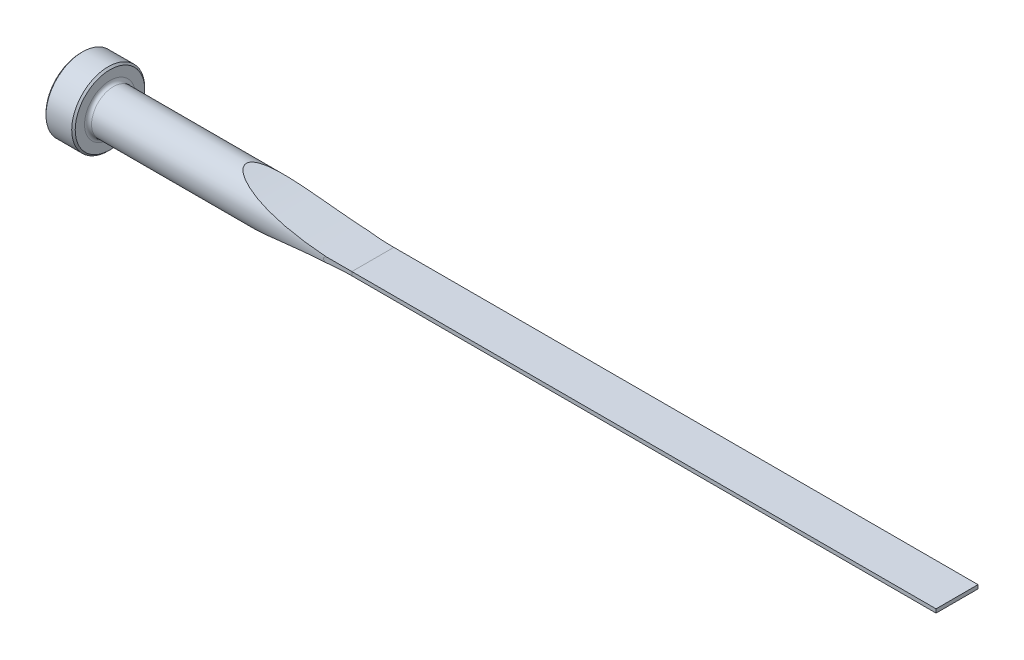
ISO-10303-21;
HEADER;
FILE_DESCRIPTION(('STEP AP214'),'2;1');
FILE_NAME('part.step','',(''),(''),'','','');
FILE_SCHEMA(('AUTOMOTIVE_DESIGN { 1 0 10303 214 1 1 1 1 }'));
ENDSEC;
DATA;
#1=APPLICATION_CONTEXT('core data for automotive mechanical design processes');
#2=APPLICATION_PROTOCOL_DEFINITION('international standard','automotive_design',2000,#1);
#3=PRODUCT_CONTEXT('',#1,'mechanical');
#4=PRODUCT('Part','Part','',(#3));
#5=PRODUCT_RELATED_PRODUCT_CATEGORY('part','',(#4));
#6=PRODUCT_DEFINITION_FORMATION('','',#4);
#7=PRODUCT_DEFINITION_CONTEXT('part definition',#1,'design');
#8=PRODUCT_DEFINITION('design','',#6,#7);
#9=PRODUCT_DEFINITION_SHAPE('','',#8);
#10=(LENGTH_UNIT() NAMED_UNIT(*) SI_UNIT(.MILLI.,.METRE.));
#11=(NAMED_UNIT(*) PLANE_ANGLE_UNIT() SI_UNIT($,.RADIAN.));
#12=(NAMED_UNIT(*) SI_UNIT($,.STERADIAN.) SOLID_ANGLE_UNIT());
#13=UNCERTAINTY_MEASURE_WITH_UNIT(LENGTH_MEASURE(1.E-05),#10,'distance_accuracy_value','');
#14=(GEOMETRIC_REPRESENTATION_CONTEXT(3) GLOBAL_UNCERTAINTY_ASSIGNED_CONTEXT((#13)) GLOBAL_UNIT_ASSIGNED_CONTEXT((#10,
#11,#12)) REPRESENTATION_CONTEXT('',''));
#15=CARTESIAN_POINT('',(0.,0.,0.));
#16=DIRECTION('',(0.,0.,1.));
#17=DIRECTION('',(1.,0.,0.));
#18=AXIS2_PLACEMENT_3D('',#15,#16,#17);
#19=CARTESIAN_POINT('',(0.,0.,0.));
#20=DIRECTION('',(-1.,0.,0.));
#21=DIRECTION('',(0.,0.,1.));
#22=AXIS2_PLACEMENT_3D('',#19,#20,#21);
#23=CYLINDRICAL_SURFACE('',#22,4.7625);
#24=CARTESIAN_POINT('',(7.112,0.,0.));
#25=DIRECTION('',(-1.,0.,0.));
#26=DIRECTION('',(0.,0.,1.));
#27=AXIS2_PLACEMENT_3D('',#24,#25,#26);
#28=CIRCLE('',#27,4.7625);
#29=CARTESIAN_POINT('',(7.112,0.,4.7625));
#30=VERTEX_POINT('',#29);
#31=EDGE_CURVE('E153',#30,#30,#28,.F.);
#32=ORIENTED_EDGE('',*,*,#31,.T.);
#33=EDGE_LOOP('',(#32));
#34=FACE_BOUND('',#33,.T.);
#35=CARTESIAN_POINT('',(63.5,1.37629566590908,4.55929999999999));
#36=CARTESIAN_POINT('',(63.300243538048,1.37627017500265,4.55929946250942));
#37=CARTESIAN_POINT('',(63.1004832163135,1.37406392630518,4.55997325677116));
#38=CARTESIAN_POINT('',(62.7010249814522,1.36511039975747,4.56266611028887));
#39=CARTESIAN_POINT('',(62.5013270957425,1.35836200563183,4.56468550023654));
#40=CARTESIAN_POINT('',(62.1003478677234,1.34006170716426,4.57009060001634));
#41=CARTESIAN_POINT('',(61.8990686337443,1.32846669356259,4.57348856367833));
#42=CARTESIAN_POINT('',(61.4969284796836,1.30007175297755,4.58164172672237));
#43=CARTESIAN_POINT('',(61.296067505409,1.28327254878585,4.58639673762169));
#44=CARTESIAN_POINT('',(60.8961767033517,1.2439534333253,4.59721659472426));
#45=CARTESIAN_POINT('',(60.6971431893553,1.22146913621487,4.6032732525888));
#46=CARTESIAN_POINT('',(60.2999040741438,1.16973426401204,4.61669265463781));
#47=CARTESIAN_POINT('',(60.1016988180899,1.14048110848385,4.62405589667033));
#48=CARTESIAN_POINT('',(59.7074850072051,1.07370926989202,4.64001372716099));
#49=CARTESIAN_POINT('',(59.5114710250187,1.03622172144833,4.64860363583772));
#50=CARTESIAN_POINT('',(59.1219644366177,0.950234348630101,4.66695416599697));
#51=CARTESIAN_POINT('',(58.9284697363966,0.901744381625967,4.67671373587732));
#52=CARTESIAN_POINT('',(58.689568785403,0.830609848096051,4.68952997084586));
#53=CARTESIAN_POINT('',(58.6417966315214,0.815810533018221,4.69213189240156));
#54=CARTESIAN_POINT('',(58.5466454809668,0.784967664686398,4.69739068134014));
#55=CARTESIAN_POINT('',(58.4992665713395,0.768923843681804,4.70004756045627));
#56=CARTESIAN_POINT('',(58.3571752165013,0.718404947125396,4.70812874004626));
#57=CARTESIAN_POINT('',(58.263234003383,0.681752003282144,4.71362458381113));
#58=CARTESIAN_POINT('',(58.0775344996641,0.599731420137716,4.72477713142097));
#59=CARTESIAN_POINT('',(57.9858203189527,0.554256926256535,4.73043499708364));
#60=CARTESIAN_POINT('',(57.8546141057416,0.476034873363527,4.73871868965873));
#61=CARTESIAN_POINT('',(57.8120990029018,0.448424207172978,4.7414354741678));
#62=CARTESIAN_POINT('',(57.7304247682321,0.388667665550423,4.74670987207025));
#63=CARTESIAN_POINT('',(57.6912549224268,0.356537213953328,4.74926798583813));
#64=CARTESIAN_POINT('',(57.6343845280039,0.30109449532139,4.75301502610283));
#65=CARTESIAN_POINT('',(57.6146643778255,0.279884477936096,4.75432176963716));
#66=CARTESIAN_POINT('',(57.578171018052,0.235020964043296,4.75675058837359));
#67=CARTESIAN_POINT('',(57.5613938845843,0.211370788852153,4.75787290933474));
#68=CARTESIAN_POINT('',(57.5361358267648,0.168085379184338,4.75956809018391));
#69=CARTESIAN_POINT('',(57.526635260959,0.149056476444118,4.76020769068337));
#70=CARTESIAN_POINT('',(57.51078402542,0.10971358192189,4.76127659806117));
#71=CARTESIAN_POINT('',(57.5044294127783,0.089401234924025,4.76170616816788));
#72=CARTESIAN_POINT('',(57.4955459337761,0.0476995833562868,4.76230708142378));
#73=CARTESIAN_POINT('',(57.4930580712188,0.0263011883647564,4.76247565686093));
#74=CARTESIAN_POINT('',(57.4924127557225,-0.0165581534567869,4.76251936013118));
#75=CARTESIAN_POINT('',(57.4942536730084,-0.0380190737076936,4.76239459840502));
#76=CARTESIAN_POINT('',(57.5014223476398,-0.0771509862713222,4.76190953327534));
#77=CARTESIAN_POINT('',(57.5062147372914,-0.0949256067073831,4.76158540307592));
#78=CARTESIAN_POINT('',(57.5183183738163,-0.129583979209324,4.76076832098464));
#79=CARTESIAN_POINT('',(57.5256312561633,-0.146467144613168,4.76027525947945));
#80=CARTESIAN_POINT('',(57.5478239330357,-0.190109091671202,4.75878258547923));
#81=CARTESIAN_POINT('',(57.564497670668,-0.215945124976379,4.75766444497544));
#82=CARTESIAN_POINT('',(57.6015159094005,-0.264813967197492,4.75519504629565));
#83=CARTESIAN_POINT('',(57.6218718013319,-0.28783769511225,4.75384306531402));
#84=CARTESIAN_POINT('',(57.6862463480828,-0.353109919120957,4.74959319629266));
#85=CARTESIAN_POINT('',(57.7337556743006,-0.391849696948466,4.74648889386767));
#86=CARTESIAN_POINT('',(57.8332528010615,-0.462955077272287,4.74007706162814));
#87=CARTESIAN_POINT('',(57.8852557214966,-0.495297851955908,4.73676885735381));
#88=CARTESIAN_POINT('',(58.0324605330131,-0.578484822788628,4.72754240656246));
#89=CARTESIAN_POINT('',(58.1303120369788,-0.624585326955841,4.72156110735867));
#90=CARTESIAN_POINT('',(58.3296567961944,-0.708279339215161,4.70972175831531));
#91=CARTESIAN_POINT('',(58.431158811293,-0.745850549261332,4.70386406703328));
#92=CARTESIAN_POINT('',(58.637175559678,-0.815246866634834,4.69233729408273));
#93=CARTESIAN_POINT('',(58.7417096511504,-0.84701459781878,4.68667050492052));
#94=CARTESIAN_POINT('',(58.9519315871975,-0.905852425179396,4.67565197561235));
#95=CARTESIAN_POINT('',(59.0576177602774,-0.932928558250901,4.67029983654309));
#96=CARTESIAN_POINT('',(59.3472077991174,-1.00180171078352,4.65615804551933));
#97=CARTESIAN_POINT('',(59.5319939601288,-1.03994988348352,4.64770520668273));
#98=CARTESIAN_POINT('',(59.9031150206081,-1.10820041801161,4.63190013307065));
#99=CARTESIAN_POINT('',(60.0894504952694,-1.13829964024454,4.62454832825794));
#100=CARTESIAN_POINT('',(60.4634968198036,-1.19209136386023,4.61097562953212));
#101=CARTESIAN_POINT('',(60.6512097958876,-1.21576959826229,4.60475726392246));
#102=CARTESIAN_POINT('',(61.0272867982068,-1.25764094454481,4.59349611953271));
#103=CARTESIAN_POINT('',(61.2156508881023,-1.2758335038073,4.58845345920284));
#104=CARTESIAN_POINT('',(61.7534776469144,-1.32086317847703,4.57577149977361));
#105=CARTESIAN_POINT('',(62.1034775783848,-1.34186157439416,4.56957976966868));
#106=CARTESIAN_POINT('',(62.628033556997,-1.36263417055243,4.56340533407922));
#107=CARTESIAN_POINT('',(62.8023917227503,-1.36777128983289,4.56186604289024));
#108=CARTESIAN_POINT('',(63.151163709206,-1.37459791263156,4.55981341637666));
#109=CARTESIAN_POINT('',(63.3255775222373,-1.37628777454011,4.55929997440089));
#110=CARTESIAN_POINT('',(63.4999999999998,-1.37629566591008,4.55929999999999));
#111=B_SPLINE_CURVE_WITH_KNOTS('',3,(#35,#36,#37,#38,#39,#40,#41,#42,#43,#44,#45,#46,#47,#48,
#49,#50,#51,#52,#53,#54,#55,#56,#57,#58,#59,#60,#61,#62,#63,#64,#65,#66,#67,#68,#69,#70,#71,#72,
#73,#74,#75,#76,#77,#78,#79,#80,#81,#82,#83,#84,#85,#86,#87,#88,#89,#90,#91,#92,#93,#94,#95,#96,
#97,#98,#99,#100,#101,#102,#103,#104,#105,#106,#107,#108,#109,#110),.UNSPECIFIED.,.F.,.F.,(4,2,
2,2,2,2,2,2,2,2,2,2,2,2,2,2,2,2,2,2,2,2,2,2,2,2,2,2,2,2,2,2,2,2,2,2,2,4),(0.,0.599262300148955,
1.19867192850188,1.80353056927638,2.40830524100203,3.00938132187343,3.6106869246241,
4.20975694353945,4.80829234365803,4.95851786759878,5.10877580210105,5.41155733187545,
5.71826557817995,5.87039269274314,6.0220127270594,6.10881533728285,6.19550132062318,
6.25911958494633,6.32265791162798,6.38686552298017,6.45104896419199,6.50606849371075,
6.56112379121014,6.65289509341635,6.74495530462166,6.92807013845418,7.11182707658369,
7.43597686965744,7.76096456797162,8.08900931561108,8.41662876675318,8.98296372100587,
9.54951926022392,10.1173235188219,10.6851849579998,11.7368092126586,12.2601040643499,
12.7833445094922),.UNSPECIFIED.);
#112=CARTESIAN_POINT('',(58.0309155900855,0.574787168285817,4.72768716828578));
#113=VERTEX_POINT('',#112);
#114=CARTESIAN_POINT('',(58.0309155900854,-0.574787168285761,4.72768716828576));
#115=VERTEX_POINT('',#114);
#116=EDGE_CURVE('E156',#113,#115,#111,.T.);
#117=ORIENTED_EDGE('',*,*,#116,.F.);
#118=CARTESIAN_POINT('',(63.5,0.406399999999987,4.74512858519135));
#119=CARTESIAN_POINT('',(63.1026745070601,0.406399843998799,4.7451190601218));
#120=CARTESIAN_POINT('',(62.7053493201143,0.409063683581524,4.74490020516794));
#121=CARTESIAN_POINT('',(61.910770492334,0.41971815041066,4.74397463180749));
#122=CARTESIAN_POINT('',(61.5135168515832,0.427708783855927,4.74326791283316));
#123=CARTESIAN_POINT('',(60.7191272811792,0.449016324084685,4.74129734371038));
#124=CARTESIAN_POINT('',(60.3219913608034,0.462333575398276,4.74003345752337));
#125=CARTESIAN_POINT('',(59.5279396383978,0.49429143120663,4.73680639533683));
#126=CARTESIAN_POINT('',(59.1310238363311,0.512932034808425,4.73484321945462));
#127=CARTESIAN_POINT('',(57.9394561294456,0.576901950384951,4.72763012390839));
#128=CARTESIAN_POINT('',(57.1452250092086,0.630246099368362,4.72105865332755));
#129=CARTESIAN_POINT('',(55.558589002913,0.758235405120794,4.70219684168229));
#130=CARTESIAN_POINT('',(54.76618404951,0.832879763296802,4.68990671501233));
#131=CARTESIAN_POINT('',(53.1835524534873,1.00343011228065,4.65640758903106));
#132=CARTESIAN_POINT('',(52.3933266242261,1.09934317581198,4.63519562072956));
#133=CARTESIAN_POINT('',(51.2104443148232,1.25905368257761,4.59338453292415));
#134=CARTESIAN_POINT('',(50.8165274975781,1.31493588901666,4.57778029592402));
#135=CARTESIAN_POINT('',(50.0296586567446,1.43195490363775,4.54253855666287));
#136=CARTESIAN_POINT('',(49.6367066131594,1.4930916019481,4.52290113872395));
#137=CARTESIAN_POINT('',(48.8518575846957,1.62059720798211,4.47879686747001));
#138=CARTESIAN_POINT('',(48.4599607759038,1.68696693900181,4.45432925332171));
#139=CARTESIAN_POINT('',(47.6774903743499,1.82488195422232,4.39962705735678));
#140=CARTESIAN_POINT('',(47.2869167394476,1.89642707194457,4.36939266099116));
#141=CARTESIAN_POINT('',(46.5074212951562,2.04461214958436,4.30204521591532));
#142=CARTESIAN_POINT('',(46.1184991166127,2.12125089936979,4.26493379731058));
#143=CARTESIAN_POINT('',(45.3425664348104,2.27953993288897,4.18247202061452));
#144=CARTESIAN_POINT('',(44.9555558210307,2.3611899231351,4.13712214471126));
#145=CARTESIAN_POINT('',(44.1831933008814,2.52951682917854,4.03640907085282));
#146=CARTESIAN_POINT('',(43.7978455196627,2.61620235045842,3.98102836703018));
#147=CARTESIAN_POINT('',(43.0301002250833,2.79427071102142,3.858130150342));
#148=CARTESIAN_POINT('',(42.6477031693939,2.88565426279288,3.79061079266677));
#149=CARTESIAN_POINT('',(41.8876227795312,3.07260204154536,3.64072869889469));
#150=CARTESIAN_POINT('',(41.5099315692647,3.16815757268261,3.55839581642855));
#151=CARTESIAN_POINT('',(40.9476753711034,3.31430622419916,3.42070481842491));
#152=CARTESIAN_POINT('',(40.7609951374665,3.36348479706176,3.37245005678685));
#153=CARTESIAN_POINT('',(40.3893485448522,3.46267714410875,3.27052654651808));
#154=CARTESIAN_POINT('',(40.2043820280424,3.51269084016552,3.21685830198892));
#155=CARTESIAN_POINT('',(39.8792293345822,3.60172890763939,3.1164639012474));
#156=CARTESIAN_POINT('',(39.7386096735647,3.64061088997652,3.0710157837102));
#157=CARTESIAN_POINT('',(39.4588579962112,3.71869891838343,2.97598216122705));
#158=CARTESIAN_POINT('',(39.3197259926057,3.75790496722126,2.92639662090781));
#159=CARTESIAN_POINT('',(39.0431177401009,3.83657136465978,2.82247755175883));
#160=CARTESIAN_POINT('',(38.9056435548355,3.87603195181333,2.76813868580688));
#161=CARTESIAN_POINT('',(38.6329587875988,3.95500631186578,2.65408085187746));
#162=CARTESIAN_POINT('',(38.4977480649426,3.99452008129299,2.59436221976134));
#163=CARTESIAN_POINT('',(38.2292960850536,4.07365258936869,2.46826704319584));
#164=CARTESIAN_POINT('',(38.0960740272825,4.11327026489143,2.40184867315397));
#165=CARTESIAN_POINT('',(37.8333710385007,4.19204775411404,2.26155326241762));
#166=CARTESIAN_POINT('',(37.7038915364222,4.2312073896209,2.1876734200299));
#167=CARTESIAN_POINT('',(37.4499378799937,4.30862416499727,2.03096404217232));
#168=CARTESIAN_POINT('',(37.3254689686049,4.34688034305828,1.94812545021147));
#169=CARTESIAN_POINT('',(37.0838358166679,4.42170051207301,1.77176900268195));
#170=CARTESIAN_POINT('',(36.9666646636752,4.45826609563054,1.67826149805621));
#171=CARTESIAN_POINT('',(36.7877199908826,4.51448373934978,1.5181774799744));
#172=CARTESIAN_POINT('',(36.7225277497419,4.5350529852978,1.45578096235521));
#173=CARTESIAN_POINT('',(36.5971449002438,4.57476044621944,1.3257517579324));
#174=CARTESIAN_POINT('',(36.5369568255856,4.59389793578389,1.25811645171));
#175=CARTESIAN_POINT('',(36.3668727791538,4.64816205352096,1.04732254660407));
#176=CARTESIAN_POINT('',(36.2661556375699,4.680550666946,0.895181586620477));
#177=CARTESIAN_POINT('',(36.1489814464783,4.71837774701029,0.651766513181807));
#178=CARTESIAN_POINT('',(36.1158107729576,4.72911592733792,0.569337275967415));
#179=CARTESIAN_POINT('',(36.0623594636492,4.74644103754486,0.399912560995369));
#180=CARTESIAN_POINT('',(36.0420697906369,4.75303087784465,0.312920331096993));
#181=CARTESIAN_POINT('',(36.0163479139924,4.76138789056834,0.135923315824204));
#182=CARTESIAN_POINT('',(36.0110091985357,4.76312471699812,0.0459031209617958));
#183=CARTESIAN_POINT('',(36.0160954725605,4.76147114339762,-0.133645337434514));
#184=CARTESIAN_POINT('',(36.0265224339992,4.75808010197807,-0.223173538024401));
#185=CARTESIAN_POINT('',(36.0607143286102,4.74697779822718,-0.392888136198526));
#186=CARTESIAN_POINT('',(36.0835203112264,4.73957720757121,-0.473295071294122));
#187=CARTESIAN_POINT('',(36.1398597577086,4.72133273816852,-0.62979513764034));
#188=CARTESIAN_POINT('',(36.1733984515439,4.71048718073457,-0.705886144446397));
#189=CARTESIAN_POINT('',(36.2738381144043,4.67809283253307,-0.901152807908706));
#190=CARTESIAN_POINT('',(36.3482314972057,4.65417680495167,-1.01606031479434));
#191=CARTESIAN_POINT('',(36.5128356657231,4.60155676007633,-1.23272194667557));
#192=CARTESIAN_POINT('',(36.6030978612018,4.57283719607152,-1.33443139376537));
#193=CARTESIAN_POINT('',(36.7883758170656,4.51425401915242,-1.52046591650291));
#194=CARTESIAN_POINT('',(36.8827773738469,4.48456363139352,-1.60546923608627));
#195=CARTESIAN_POINT('',(37.0782410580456,4.42347381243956,-1.76684360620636));
#196=CARTESIAN_POINT('',(37.1793094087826,4.39207278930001,-1.84320640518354));
#197=CARTESIAN_POINT('',(37.3864508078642,4.32814203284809,-1.98869631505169));
#198=CARTESIAN_POINT('',(37.4925332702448,4.29561020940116,-2.05780896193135));
#199=CARTESIAN_POINT('',(37.708284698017,4.22990413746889,-2.18968796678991));
#200=CARTESIAN_POINT('',(37.8179522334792,4.1967301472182,-2.25245681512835));
#201=CARTESIAN_POINT('',(38.1008694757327,4.11176216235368,-2.40544145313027));
#202=CARTESIAN_POINT('',(38.2760784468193,4.05971107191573,-2.49188484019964));
#203=CARTESIAN_POINT('',(38.6312638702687,3.95541706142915,-2.65431239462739));
#204=CARTESIAN_POINT('',(38.8112427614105,3.90317405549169,-2.73029108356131));
#205=CARTESIAN_POINT('',(39.1750027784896,3.79885427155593,-2.87367043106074));
#206=CARTESIAN_POINT('',(39.358790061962,3.74677795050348,-2.94105569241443));
#207=CARTESIAN_POINT('',(39.7290553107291,3.64316890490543,-3.06846263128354));
#208=CARTESIAN_POINT('',(39.915533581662,3.59163624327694,-3.12848346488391));
#209=CARTESIAN_POINT('',(40.2915924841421,3.48904737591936,-3.2425089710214));
#210=CARTESIAN_POINT('',(40.481184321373,3.43799514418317,-3.29648006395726));
#211=CARTESIAN_POINT('',(40.8620944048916,3.33678868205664,-3.39888617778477));
#212=CARTESIAN_POINT('',(41.0534127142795,3.2866344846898,-3.44732099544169));
#213=CARTESIAN_POINT('',(41.4372368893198,3.18739089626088,-3.53928192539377));
#214=CARTESIAN_POINT('',(41.6297410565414,3.13830030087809,-3.58281385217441));
#215=CARTESIAN_POINT('',(42.0159311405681,3.04120169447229,-3.66559149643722));
#216=CARTESIAN_POINT('',(42.2096170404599,2.99319366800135,-3.70483727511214));
#217=CARTESIAN_POINT('',(42.7916930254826,2.85100463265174,-3.81677454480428));
#218=CARTESIAN_POINT('',(43.1815995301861,2.75852978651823,-3.88378247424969));
#219=CARTESIAN_POINT('',(43.9644614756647,2.57846824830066,-4.00558232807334));
#220=CARTESIAN_POINT('',(44.3574174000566,2.49088235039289,-4.06037227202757));
#221=CARTESIAN_POINT('',(45.1458992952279,2.32077052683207,-4.15994533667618));
#222=CARTESIAN_POINT('',(45.5414265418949,2.2382473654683,-4.2047230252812));
#223=CARTESIAN_POINT('',(46.3343932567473,2.07844836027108,-4.28596381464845));
#224=CARTESIAN_POINT('',(46.7318327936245,2.00117270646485,-4.32242661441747));
#225=CARTESIAN_POINT('',(47.5292695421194,1.85177898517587,-4.38850836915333));
#226=CARTESIAN_POINT('',(47.9292706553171,1.77967421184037,-4.41811009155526));
#227=CARTESIAN_POINT('',(48.7306003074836,1.64089830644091,-4.47150793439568));
#228=CARTESIAN_POINT('',(49.1319288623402,1.57422723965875,-4.49530398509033));
#229=CARTESIAN_POINT('',(49.9355884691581,1.44638497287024,-4.53805236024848));
#230=CARTESIAN_POINT('',(50.3379191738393,1.38521208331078,-4.55700617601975));
#231=CARTESIAN_POINT('',(51.1435512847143,1.26837488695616,-4.59089528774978));
#232=CARTESIAN_POINT('',(51.5468527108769,1.21271069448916,-4.60583050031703));
#233=CARTESIAN_POINT('',(52.7573121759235,1.05411059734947,-4.64566605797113));
#234=CARTESIAN_POINT('',(53.5657329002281,0.959454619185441,-4.6656313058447));
#235=CARTESIAN_POINT('',(55.1850679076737,0.792364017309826,-4.69688739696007));
#236=CARTESIAN_POINT('',(55.9959823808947,0.719931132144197,-4.70817756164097));
#237=CARTESIAN_POINT('',(57.6185284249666,0.597441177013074,-4.72528178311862));
#238=CARTESIAN_POINT('',(58.4301578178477,0.547356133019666,-4.731102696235));
#239=CARTESIAN_POINT('',(60.0544469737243,0.469475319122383,-4.73946638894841));
#240=CARTESIAN_POINT('',(60.8671066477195,0.441677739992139,-4.74200943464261));
#241=CARTESIAN_POINT('',(61.9834159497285,0.418818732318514,-4.74405084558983));
#242=CARTESIAN_POINT('',(62.2868904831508,0.414159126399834,-4.7444585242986));
#243=CARTESIAN_POINT('',(62.8935754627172,0.407951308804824,-4.74499664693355));
#244=CARTESIAN_POINT('',(63.1967858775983,0.406400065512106,-4.7451273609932));
#245=CARTESIAN_POINT('',(63.4999999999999,0.406399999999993,-4.74512858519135));
#246=B_SPLINE_CURVE_WITH_KNOTS('',3,(#118,#119,#120,#121,#122,#123,#124,#125,#126,#127,#128,
#129,#130,#131,#132,#133,#134,#135,#136,#137,#138,#139,#140,#141,#142,#143,#144,#145,#146,#147,
#148,#149,#150,#151,#152,#153,#154,#155,#156,#157,#158,#159,#160,#161,#162,#163,#164,#165,#166,
#167,#168,#169,#170,#171,#172,#173,#174,#175,#176,#177,#178,#179,#180,#181,#182,#183,#184,#185,
#186,#187,#188,#189,#190,#191,#192,#193,#194,#195,#196,#197,#198,#199,#200,#201,#202,#203,#204,
#205,#206,#207,#208,#209,#210,#211,#212,#213,#214,#215,#216,#217,#218,#219,#220,#221,#222,#223,
#224,#225,#226,#227,#228,#229,#230,#231,#232,#233,#234,#235,#236,#237,#238,#239,#240,#241,#242,
#243,#244,#245),.UNSPECIFIED.,.F.,.F.,(4,2,2,2,2,2,2,2,2,2,2,2,2,2,2,2,2,2,2,2,2,2,2,2,2,2,2,2,
2,2,2,2,2,2,2,2,2,2,2,2,2,2,2,2,2,2,2,2,2,2,2,2,2,2,2,2,2,2,2,2,2,2,2,4),(0.,1.19196684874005,
2.38393508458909,3.57598043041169,4.76802557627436,7.15583924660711,9.54356340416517,
11.9320827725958,13.1265378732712,14.3209680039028,15.5155864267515,16.7101664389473,
17.9044636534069,19.0986909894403,20.2950229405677,21.4915368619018,22.6856659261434,
23.282568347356,23.8794152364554,24.3377948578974,24.7961783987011,25.2550833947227,
25.7139597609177,26.175902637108,26.6380196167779,27.1006082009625,27.562751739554,
27.8401229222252,28.117633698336,28.6674621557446,28.9350509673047,29.2024518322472,
29.4715210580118,29.7406239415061,29.991359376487,30.2422171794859,30.6566912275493,
31.0725336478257,31.4633177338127,31.8544719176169,32.2463921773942,32.6381579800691,
33.2442660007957,33.8506901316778,34.4581859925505,35.06575140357,35.6765376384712,
36.2873462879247,36.8974227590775,37.5074905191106,38.7260446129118,39.9447960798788,
41.1642071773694,42.3836624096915,43.606148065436,44.8286484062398,46.0507717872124,
47.2729205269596,49.7150672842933,52.15740504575,54.5966769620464,57.035750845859,
57.9462702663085,58.8559012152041),.UNSPECIFIED.);
#247=CARTESIAN_POINT('',(58.0309155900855,0.574787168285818,-4.72768716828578));
#248=VERTEX_POINT('',#247);
#249=EDGE_CURVE('E106',#113,#248,#246,.T.);
#250=ORIENTED_EDGE('',*,*,#249,.T.);
#251=CARTESIAN_POINT('',(63.5,1.37629566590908,-4.55929999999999));
#252=CARTESIAN_POINT('',(63.3002435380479,1.37627017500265,-4.55929946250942));
#253=CARTESIAN_POINT('',(63.1004832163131,1.37406392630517,-4.55997325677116));
#254=CARTESIAN_POINT('',(62.7010249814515,1.36511039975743,-4.56266611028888));
#255=CARTESIAN_POINT('',(62.5013270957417,1.35836200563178,-4.56468550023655));
#256=CARTESIAN_POINT('',(62.1003478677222,1.34006170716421,-4.57009060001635));
#257=CARTESIAN_POINT('',(61.899068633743,1.32846669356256,-4.57348856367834));
#258=CARTESIAN_POINT('',(61.496928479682,1.30007175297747,-4.58164172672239));
#259=CARTESIAN_POINT('',(61.2960675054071,1.28327254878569,-4.58639673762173));
#260=CARTESIAN_POINT('',(60.8961767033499,1.2439534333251,-4.59721659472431));
#261=CARTESIAN_POINT('',(60.6971431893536,1.22146913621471,-4.60327325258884));
#262=CARTESIAN_POINT('',(60.2999040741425,1.16973426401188,-4.61669265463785));
#263=CARTESIAN_POINT('',(60.1016988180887,1.14048110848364,-4.62405589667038));
#264=CARTESIAN_POINT('',(59.7074850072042,1.07370926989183,-4.64001372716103));
#265=CARTESIAN_POINT('',(59.5114710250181,1.03622172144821,-4.64860363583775));
#266=CARTESIAN_POINT('',(59.1219644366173,0.950234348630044,-4.66695416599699));
#267=CARTESIAN_POINT('',(58.9284697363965,0.901744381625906,-4.67671373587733));
#268=CARTESIAN_POINT('',(58.689568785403,0.830609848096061,-4.68952997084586));
#269=CARTESIAN_POINT('',(58.6417966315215,0.815810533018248,-4.69213189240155));
#270=CARTESIAN_POINT('',(58.546645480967,0.784967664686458,-4.69739068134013));
#271=CARTESIAN_POINT('',(58.4992665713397,0.76892384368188,-4.70004756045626));
#272=CARTESIAN_POINT('',(58.3571752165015,0.718404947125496,-4.70812874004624));
#273=CARTESIAN_POINT('',(58.2632340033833,0.681752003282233,-4.71362458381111));
#274=CARTESIAN_POINT('',(58.0775344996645,0.599731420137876,-4.72477713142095));
#275=CARTESIAN_POINT('',(57.9858203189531,0.554256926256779,-4.73043499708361));
#276=CARTESIAN_POINT('',(57.8546141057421,0.476034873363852,-4.7387186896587));
#277=CARTESIAN_POINT('',(57.8120990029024,0.448424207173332,-4.74143547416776));
#278=CARTESIAN_POINT('',(57.7304247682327,0.388667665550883,-4.74670987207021));
#279=CARTESIAN_POINT('',(57.6912549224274,0.356537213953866,-4.74926798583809));
#280=CARTESIAN_POINT('',(57.6343845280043,0.301094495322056,-4.75301502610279));
#281=CARTESIAN_POINT('',(57.6146643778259,0.279884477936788,-4.75432176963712));
#282=CARTESIAN_POINT('',(57.5781710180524,0.235020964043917,-4.75675058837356));
#283=CARTESIAN_POINT('',(57.5613938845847,0.211370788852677,-4.75787290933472));
#284=CARTESIAN_POINT('',(57.5361358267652,0.168085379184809,-4.7595680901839));
#285=CARTESIAN_POINT('',(57.5266352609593,0.149056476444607,-4.76020769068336));
#286=CARTESIAN_POINT('',(57.5107840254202,0.109713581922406,-4.76127659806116));
#287=CARTESIAN_POINT('',(57.5044294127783,0.0894012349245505,-4.76170616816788));
#288=CARTESIAN_POINT('',(57.495545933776,0.0476995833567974,-4.76230708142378));
#289=CARTESIAN_POINT('',(57.4930580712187,0.026301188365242,-4.76247565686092));
#290=CARTESIAN_POINT('',(57.4924127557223,-0.0165581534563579,-4.76251936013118));
#291=CARTESIAN_POINT('',(57.4942536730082,-0.0380190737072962,-4.76239459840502));
#292=CARTESIAN_POINT('',(57.5014223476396,-0.0771509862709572,-4.76190953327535));
#293=CARTESIAN_POINT('',(57.5062147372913,-0.0949256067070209,-4.76158540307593));
#294=CARTESIAN_POINT('',(57.5183183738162,-0.129583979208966,-4.76076832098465));
#295=CARTESIAN_POINT('',(57.5256312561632,-0.146467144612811,-4.76027525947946));
#296=CARTESIAN_POINT('',(57.5478239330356,-0.190109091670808,-4.75878258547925));
#297=CARTESIAN_POINT('',(57.5644976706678,-0.215945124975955,-4.75766444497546));
#298=CARTESIAN_POINT('',(57.6015159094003,-0.264813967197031,-4.75519504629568));
#299=CARTESIAN_POINT('',(57.6218718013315,-0.287837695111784,-4.75384306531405));
#300=CARTESIAN_POINT('',(57.6862463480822,-0.353109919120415,-4.7495931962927));
#301=CARTESIAN_POINT('',(57.7337556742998,-0.391849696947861,-4.74648889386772));
#302=CARTESIAN_POINT('',(57.8332528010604,-0.462955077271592,-4.7400770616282));
#303=CARTESIAN_POINT('',(57.8852557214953,-0.495297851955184,-4.73676885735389));
#304=CARTESIAN_POINT('',(58.0324605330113,-0.578484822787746,-4.72754240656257));
#305=CARTESIAN_POINT('',(58.1303120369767,-0.624585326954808,-4.72156110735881));
#306=CARTESIAN_POINT('',(58.3296567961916,-0.708279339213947,-4.70972175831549));
#307=CARTESIAN_POINT('',(58.4311588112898,-0.74585054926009,-4.70386406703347));
#308=CARTESIAN_POINT('',(58.6371755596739,-0.815246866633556,-4.69233729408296));
#309=CARTESIAN_POINT('',(58.741709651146,-0.847014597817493,-4.68667050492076));
#310=CARTESIAN_POINT('',(58.9519315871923,-0.905852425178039,-4.67565197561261));
#311=CARTESIAN_POINT('',(59.0576177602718,-0.932928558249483,-4.67029983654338));
#312=CARTESIAN_POINT('',(59.3472077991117,-1.00180171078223,-4.65615804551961));
#313=CARTESIAN_POINT('',(59.5319939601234,-1.03994988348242,-4.64770520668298));
#314=CARTESIAN_POINT('',(59.9031150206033,-1.10820041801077,-4.63190013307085));
#315=CARTESIAN_POINT('',(60.0894504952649,-1.13829964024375,-4.62454832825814));
#316=CARTESIAN_POINT('',(60.4634968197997,-1.19209136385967,-4.61097562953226));
#317=CARTESIAN_POINT('',(60.651209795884,-1.21576959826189,-4.60475726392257));
#318=CARTESIAN_POINT('',(61.0272867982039,-1.25764094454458,-4.59349611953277));
#319=CARTESIAN_POINT('',(61.2156508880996,-1.27583350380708,-4.5884534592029));
#320=CARTESIAN_POINT('',(61.7534776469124,-1.32086317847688,-4.57577149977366));
#321=CARTESIAN_POINT('',(62.1034775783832,-1.34186157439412,-4.56957976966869));
#322=CARTESIAN_POINT('',(62.6280335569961,-1.36263417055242,-4.56340533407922));
#323=CARTESIAN_POINT('',(62.8023917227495,-1.36777128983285,-4.56186604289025));
#324=CARTESIAN_POINT('',(63.1511637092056,-1.37459791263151,-4.55981341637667));
#325=CARTESIAN_POINT('',(63.3255775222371,-1.37628777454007,-4.5592999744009));
#326=CARTESIAN_POINT('',(63.4999999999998,-1.37629566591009,-4.55929999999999));
#327=B_SPLINE_CURVE_WITH_KNOTS('',3,(#251,#252,#253,#254,#255,#256,#257,#258,#259,#260,#261,
#262,#263,#264,#265,#266,#267,#268,#269,#270,#271,#272,#273,#274,#275,#276,#277,#278,#279,#280,
#281,#282,#283,#284,#285,#286,#287,#288,#289,#290,#291,#292,#293,#294,#295,#296,#297,#298,#299,
#300,#301,#302,#303,#304,#305,#306,#307,#308,#309,#310,#311,#312,#313,#314,#315,#316,#317,#318,
#319,#320,#321,#322,#323,#324,#325,#326),.UNSPECIFIED.,.F.,.F.,(4,2,2,2,2,2,2,2,2,2,2,2,2,2,2,2,
2,2,2,2,2,2,2,2,2,2,2,2,2,2,2,2,2,2,2,2,2,4),(0.,0.599262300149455,1.19867192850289,
1.80353056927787,2.40830524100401,3.00938132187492,3.61068692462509,4.20975694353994,
4.80829234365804,4.95851786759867,5.10877580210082,5.41155733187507,5.71826557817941,
5.87039269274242,6.02201272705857,6.10881533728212,6.19550132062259,6.25911958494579,
6.32265791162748,6.38686552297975,6.45104896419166,6.50606849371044,6.56112379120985,
6.65289509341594,6.7449553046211,6.92807013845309,7.11182707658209,7.43597686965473,
7.7609645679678,8.08900931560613,8.4166287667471,8.98296372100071,9.54951926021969,
10.1173235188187,10.6851849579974,11.7368092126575,12.2601040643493,12.7833445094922),.UNSPECIFIED.);
#328=CARTESIAN_POINT('',(58.0309155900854,-0.574787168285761,-4.72768716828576));
#329=VERTEX_POINT('',#328);
#330=EDGE_CURVE('E175',#248,#329,#327,.T.);
#331=ORIENTED_EDGE('',*,*,#330,.T.);
#332=CARTESIAN_POINT('',(63.5,-0.406399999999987,4.74512858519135));
#333=CARTESIAN_POINT('',(63.1026745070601,-0.406399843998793,4.7451190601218));
#334=CARTESIAN_POINT('',(62.7053493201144,-0.409063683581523,4.74490020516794));
#335=CARTESIAN_POINT('',(61.910770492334,-0.419718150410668,4.74397463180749));
#336=CARTESIAN_POINT('',(61.5135168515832,-0.42770878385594,4.74326791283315));
#337=CARTESIAN_POINT('',(60.7191272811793,-0.449016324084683,4.74129734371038));
#338=CARTESIAN_POINT('',(60.3219913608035,-0.462333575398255,4.74003345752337));
#339=CARTESIAN_POINT('',(59.5279396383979,-0.494291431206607,4.73680639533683));
#340=CARTESIAN_POINT('',(59.1310238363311,-0.51293203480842,4.73484321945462));
#341=CARTESIAN_POINT('',(57.9394561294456,-0.576901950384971,4.72763012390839));
#342=CARTESIAN_POINT('',(57.1452250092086,-0.630246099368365,4.72105865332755));
#343=CARTESIAN_POINT('',(55.5585890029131,-0.758235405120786,4.70219684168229));
#344=CARTESIAN_POINT('',(54.7661840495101,-0.8328797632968,4.68990671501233));
#345=CARTESIAN_POINT('',(53.1835524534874,-1.00343011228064,4.65640758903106));
#346=CARTESIAN_POINT('',(52.3933266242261,-1.09934317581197,4.63519562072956));
#347=CARTESIAN_POINT('',(51.2104443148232,-1.25905368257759,4.59338453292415));
#348=CARTESIAN_POINT('',(50.8165274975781,-1.31493588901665,4.57778029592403));
#349=CARTESIAN_POINT('',(50.0296586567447,-1.43195490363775,4.54253855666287));
#350=CARTESIAN_POINT('',(49.6367066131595,-1.4930916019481,4.52290113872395));
#351=CARTESIAN_POINT('',(48.8518575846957,-1.6205972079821,4.47879686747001));
#352=CARTESIAN_POINT('',(48.4599607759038,-1.6869669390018,4.45432925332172));
#353=CARTESIAN_POINT('',(47.67749037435,-1.82488195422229,4.39962705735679));
#354=CARTESIAN_POINT('',(47.2869167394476,-1.89642707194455,4.36939266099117));
#355=CARTESIAN_POINT('',(46.5074212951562,-2.04461214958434,4.30204521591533));
#356=CARTESIAN_POINT('',(46.1184991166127,-2.12125089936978,4.26493379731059));
#357=CARTESIAN_POINT('',(45.3425664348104,-2.27953993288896,4.18247202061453));
#358=CARTESIAN_POINT('',(44.9555558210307,-2.36118992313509,4.13712214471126));
#359=CARTESIAN_POINT('',(44.1831933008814,-2.52951682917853,4.03640907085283));
#360=CARTESIAN_POINT('',(43.7978455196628,-2.61620235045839,3.9810283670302));
#361=CARTESIAN_POINT('',(43.0301002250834,-2.7942707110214,3.85813015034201));
#362=CARTESIAN_POINT('',(42.647703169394,-2.88565426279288,3.79061079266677));
#363=CARTESIAN_POINT('',(41.8876227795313,-3.07260204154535,3.6407286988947));
#364=CARTESIAN_POINT('',(41.5099315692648,-3.16815757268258,3.55839581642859));
#365=CARTESIAN_POINT('',(40.9476753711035,-3.31430622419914,3.42070481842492));
#366=CARTESIAN_POINT('',(40.7609951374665,-3.36348479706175,3.37245005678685));
#367=CARTESIAN_POINT('',(40.3893485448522,-3.46267714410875,3.27052654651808));
#368=CARTESIAN_POINT('',(40.2043820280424,-3.5126908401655,3.21685830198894));
#369=CARTESIAN_POINT('',(39.8792293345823,-3.60172890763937,3.11646390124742));
#370=CARTESIAN_POINT('',(39.7386096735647,-3.64061088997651,3.07101578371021));
#371=CARTESIAN_POINT('',(39.4588579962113,-3.71869891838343,2.97598216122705));
#372=CARTESIAN_POINT('',(39.3197259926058,-3.75790496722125,2.92639662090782));
#373=CARTESIAN_POINT('',(39.043117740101,-3.83657136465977,2.82247755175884));
#374=CARTESIAN_POINT('',(38.9056435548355,-3.87603195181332,2.76813868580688));
#375=CARTESIAN_POINT('',(38.6329587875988,-3.95500631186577,2.65408085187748));
#376=CARTESIAN_POINT('',(38.4977480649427,-3.99452008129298,2.59436221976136));
#377=CARTESIAN_POINT('',(38.2292960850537,-4.07365258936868,2.46826704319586));
#378=CARTESIAN_POINT('',(38.0960740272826,-4.11327026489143,2.40184867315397));
#379=CARTESIAN_POINT('',(37.8333710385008,-4.19204775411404,2.26155326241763));
#380=CARTESIAN_POINT('',(37.7038915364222,-4.23120738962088,2.18767342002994));
#381=CARTESIAN_POINT('',(37.4499378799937,-4.30862416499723,2.03096404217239));
#382=CARTESIAN_POINT('',(37.3254689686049,-4.34688034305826,1.94812545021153));
#383=CARTESIAN_POINT('',(37.0838358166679,-4.42170051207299,1.77176900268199));
#384=CARTESIAN_POINT('',(36.9666646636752,-4.45826609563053,1.67826149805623));
#385=CARTESIAN_POINT('',(36.7877199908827,-4.51448373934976,1.51817747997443));
#386=CARTESIAN_POINT('',(36.7225277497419,-4.53505298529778,1.45578096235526));
#387=CARTESIAN_POINT('',(36.5971449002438,-4.57476044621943,1.32575175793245));
#388=CARTESIAN_POINT('',(36.5369568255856,-4.59389793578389,1.25811645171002));
#389=CARTESIAN_POINT('',(36.3668727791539,-4.64816205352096,1.04732254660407));
#390=CARTESIAN_POINT('',(36.2661556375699,-4.68055066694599,0.895181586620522));
#391=CARTESIAN_POINT('',(36.1489814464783,-4.71837774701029,0.651766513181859));
#392=CARTESIAN_POINT('',(36.1158107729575,-4.72911592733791,0.569337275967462));
#393=CARTESIAN_POINT('',(36.0623594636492,-4.74644103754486,0.399912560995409));
#394=CARTESIAN_POINT('',(36.0420697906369,-4.75303087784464,0.312920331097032));
#395=CARTESIAN_POINT('',(36.0163479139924,-4.76138789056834,0.135923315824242));
#396=CARTESIAN_POINT('',(36.0110091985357,-4.76312471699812,0.045903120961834));
#397=CARTESIAN_POINT('',(36.0160954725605,-4.76147114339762,-0.133645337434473));
#398=CARTESIAN_POINT('',(36.0265224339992,-4.75808010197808,-0.223173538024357));
#399=CARTESIAN_POINT('',(36.0607143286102,-4.74697779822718,-0.392888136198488));
#400=CARTESIAN_POINT('',(36.0835203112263,-4.73957720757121,-0.473295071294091));
#401=CARTESIAN_POINT('',(36.1398597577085,-4.72133273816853,-0.62979513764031));
#402=CARTESIAN_POINT('',(36.1733984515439,-4.71048718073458,-0.70588614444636));
#403=CARTESIAN_POINT('',(36.2738381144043,-4.67809283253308,-0.901152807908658));
#404=CARTESIAN_POINT('',(36.3482314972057,-4.65417680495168,-1.0160603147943));
#405=CARTESIAN_POINT('',(36.512835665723,-4.60155676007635,-1.23272194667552));
#406=CARTESIAN_POINT('',(36.6030978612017,-4.57283719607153,-1.33443139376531));
#407=CARTESIAN_POINT('',(36.7883758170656,-4.51425401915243,-1.52046591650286));
#408=CARTESIAN_POINT('',(36.8827773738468,-4.48456363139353,-1.60546923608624));
#409=CARTESIAN_POINT('',(37.0782410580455,-4.42347381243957,-1.76684360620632));
#410=CARTESIAN_POINT('',(37.1793094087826,-4.39207278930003,-1.84320640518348));
#411=CARTESIAN_POINT('',(37.3864508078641,-4.32814203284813,-1.98869631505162));
#412=CARTESIAN_POINT('',(37.4925332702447,-4.29561020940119,-2.05780896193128));
#413=CARTESIAN_POINT('',(37.7082846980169,-4.22990413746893,-2.18968796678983));
#414=CARTESIAN_POINT('',(37.8179522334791,-4.19673014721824,-2.25245681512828));
#415=CARTESIAN_POINT('',(38.1008694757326,-4.11176216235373,-2.40544145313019));
#416=CARTESIAN_POINT('',(38.2760784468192,-4.05971107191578,-2.49188484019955));
#417=CARTESIAN_POINT('',(38.6312638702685,-3.95541706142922,-2.6543123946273));
#418=CARTESIAN_POINT('',(38.8112427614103,-3.90317405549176,-2.73029108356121));
#419=CARTESIAN_POINT('',(39.1750027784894,-3.79885427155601,-2.87367043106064));
#420=CARTESIAN_POINT('',(39.3587900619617,-3.74677795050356,-2.94105569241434));
#421=CARTESIAN_POINT('',(39.7290553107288,-3.64316890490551,-3.06846263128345));
#422=CARTESIAN_POINT('',(39.9155335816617,-3.59163624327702,-3.12848346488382));
#423=CARTESIAN_POINT('',(40.2915924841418,-3.48904737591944,-3.24250897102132));
#424=CARTESIAN_POINT('',(40.4811843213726,-3.43799514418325,-3.29648006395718));
#425=CARTESIAN_POINT('',(40.8620944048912,-3.33678868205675,-3.39888617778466));
#426=CARTESIAN_POINT('',(41.0534127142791,-3.28663448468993,-3.44732099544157));
#427=CARTESIAN_POINT('',(41.4372368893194,-3.18739089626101,-3.53928192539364));
#428=CARTESIAN_POINT('',(41.629741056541,-3.1383003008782,-3.58281385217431));
#429=CARTESIAN_POINT('',(42.0159311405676,-3.04120169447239,-3.66559149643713));
#430=CARTESIAN_POINT('',(42.2096170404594,-2.99319366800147,-3.70483727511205));
#431=CARTESIAN_POINT('',(42.7916930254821,-2.85100463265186,-3.81677454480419));
#432=CARTESIAN_POINT('',(43.1815995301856,-2.75852978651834,-3.88378247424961));
#433=CARTESIAN_POINT('',(43.9644614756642,-2.57846824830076,-4.00558232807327));
#434=CARTESIAN_POINT('',(44.3574174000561,-2.490882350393,-4.0603722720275));
#435=CARTESIAN_POINT('',(45.1458992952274,-2.32077052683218,-4.15994533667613));
#436=CARTESIAN_POINT('',(45.5414265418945,-2.23824736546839,-4.20472302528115));
#437=CARTESIAN_POINT('',(46.3343932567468,-2.07844836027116,-4.28596381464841));
#438=CARTESIAN_POINT('',(46.7318327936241,-2.00117270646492,-4.32242661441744));
#439=CARTESIAN_POINT('',(47.529269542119,-1.85177898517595,-4.38850836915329));
#440=CARTESIAN_POINT('',(47.9292706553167,-1.77967421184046,-4.41811009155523));
#441=CARTESIAN_POINT('',(48.7306003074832,-1.640898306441,-4.47150793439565));
#442=CARTESIAN_POINT('',(49.1319288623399,-1.57422723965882,-4.49530398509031));
#443=CARTESIAN_POINT('',(49.9355884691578,-1.44638497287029,-4.53805236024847));
#444=CARTESIAN_POINT('',(50.3379191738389,-1.38521208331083,-4.55700617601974));
#445=CARTESIAN_POINT('',(51.143551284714,-1.26837488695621,-4.59089528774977));
#446=CARTESIAN_POINT('',(51.5468527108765,-1.2127106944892,-4.60583050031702));
#447=CARTESIAN_POINT('',(52.7573121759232,-1.0541105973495,-4.64566605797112));
#448=CARTESIAN_POINT('',(53.5657329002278,-0.959454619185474,-4.66563130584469));
#449=CARTESIAN_POINT('',(55.1850679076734,-0.792364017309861,-4.69688739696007));
#450=CARTESIAN_POINT('',(55.9959823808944,-0.719931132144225,-4.70817756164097));
#451=CARTESIAN_POINT('',(57.6185284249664,-0.597441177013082,-4.72528178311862));
#452=CARTESIAN_POINT('',(58.4301578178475,-0.547356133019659,-4.731102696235));
#453=CARTESIAN_POINT('',(60.0544469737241,-0.469475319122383,-4.73946638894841));
#454=CARTESIAN_POINT('',(60.8671066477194,-0.441677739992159,-4.74200943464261));
#455=CARTESIAN_POINT('',(61.9834159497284,-0.418818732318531,-4.74405084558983));
#456=CARTESIAN_POINT('',(62.2868904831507,-0.414159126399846,-4.7444585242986));
#457=CARTESIAN_POINT('',(62.8935754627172,-0.407951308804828,-4.74499664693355));
#458=CARTESIAN_POINT('',(63.1967858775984,-0.406400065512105,-4.7451273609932));
#459=CARTESIAN_POINT('',(63.5,-0.406399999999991,-4.74512858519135));
#460=B_SPLINE_CURVE_WITH_KNOTS('',3,(#332,#333,#334,#335,#336,#337,#338,#339,#340,#341,#342,
#343,#344,#345,#346,#347,#348,#349,#350,#351,#352,#353,#354,#355,#356,#357,#358,#359,#360,#361,
#362,#363,#364,#365,#366,#367,#368,#369,#370,#371,#372,#373,#374,#375,#376,#377,#378,#379,#380,
#381,#382,#383,#384,#385,#386,#387,#388,#389,#390,#391,#392,#393,#394,#395,#396,#397,#398,#399,
#400,#401,#402,#403,#404,#405,#406,#407,#408,#409,#410,#411,#412,#413,#414,#415,#416,#417,#418,
#419,#420,#421,#422,#423,#424,#425,#426,#427,#428,#429,#430,#431,#432,#433,#434,#435,#436,#437,
#438,#439,#440,#441,#442,#443,#444,#445,#446,#447,#448,#449,#450,#451,#452,#453,#454,#455,#456,
#457,#458,#459),.UNSPECIFIED.,.F.,.F.,(4,2,2,2,2,2,2,2,2,2,2,2,2,2,2,2,2,2,2,2,2,2,2,2,2,2,2,2,
2,2,2,2,2,2,2,2,2,2,2,2,2,2,2,2,2,2,2,2,2,2,2,2,2,2,2,2,2,2,2,2,2,2,2,4),(0.,1.19196684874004,
2.38393508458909,3.57598043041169,4.76802557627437,7.15583924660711,9.54356340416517,
11.9320827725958,13.1265378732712,14.3209680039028,15.5155864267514,16.7101664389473,
17.9044636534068,19.0986909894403,20.2950229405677,21.4915368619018,22.6856659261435,
23.282568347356,23.8794152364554,24.3377948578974,24.7961783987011,25.2550833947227,
25.7139597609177,26.175902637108,26.6380196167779,27.1006082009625,27.562751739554,
27.8401229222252,28.117633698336,28.6674621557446,28.9350509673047,29.2024518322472,
29.4715210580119,29.7406239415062,29.9913593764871,30.2422171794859,30.6566912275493,
31.0725336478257,31.4633177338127,31.8544719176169,32.2463921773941,32.638157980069,
33.2442660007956,33.8506901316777,34.4581859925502,35.0657514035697,35.6765376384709,
36.2873462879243,36.897422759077,37.5074905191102,38.7260446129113,39.9447960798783,
41.164207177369,42.3836624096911,43.6061480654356,44.8286484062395,46.0507717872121,
47.2729205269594,49.7150672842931,52.1574050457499,54.5966769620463,57.035750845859,
57.9462702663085,58.8559012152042),.UNSPECIFIED.);
#461=EDGE_CURVE('E105',#115,#329,#460,.T.);
#462=ORIENTED_EDGE('',*,*,#461,.F.);
#463=EDGE_LOOP('',(#117,#250,#331,#462));
#464=FACE_BOUND('',#463,.T.);
#465=ADVANCED_FACE('F33',(#34,#464),#23,.T.);
#466=CARTESIAN_POINT('',(190.5,4.7625,0.));
#467=DIRECTION('',(-1.,0.,0.));
#468=DIRECTION('',(0.,0.,1.));
#469=AXIS2_PLACEMENT_3D('',#466,#467,#468);
#470=PLANE('',#469);
#471=DIRECTION('',(0.,1.,0.));
#472=VECTOR('',#471,1.);
#473=CARTESIAN_POINT('',(190.5,-7.9375,4.5593));
#474=LINE('',#473,#472);
#475=CARTESIAN_POINT('',(190.5,-0.406400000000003,4.5593));
#476=VERTEX_POINT('',#475);
#477=CARTESIAN_POINT('',(190.5,0.406400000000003,4.5593));
#478=VERTEX_POINT('',#477);
#479=EDGE_CURVE('E87',#476,#478,#474,.T.);
#480=ORIENTED_EDGE('',*,*,#479,.F.);
#481=DIRECTION('',(0.,0.,1.));
#482=VECTOR('',#481,1.);
#483=CARTESIAN_POINT('',(190.5,-0.406400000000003,0.));
#484=LINE('',#483,#482);
#485=CARTESIAN_POINT('',(190.5,-0.406400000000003,-4.5593));
#486=VERTEX_POINT('',#485);
#487=EDGE_CURVE('E100',#486,#476,#484,.T.);
#488=ORIENTED_EDGE('',*,*,#487,.F.);
#489=DIRECTION('',(0.,1.,0.));
#490=VECTOR('',#489,1.);
#491=CARTESIAN_POINT('',(190.5,-7.9375,-4.5593));
#492=LINE('',#491,#490);
#493=CARTESIAN_POINT('',(190.5,0.406399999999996,-4.5593));
#494=VERTEX_POINT('',#493);
#495=EDGE_CURVE('E56',#486,#494,#492,.T.);
#496=ORIENTED_EDGE('',*,*,#495,.T.);
#497=DIRECTION('',(0.,0.,1.));
#498=VECTOR('',#497,1.);
#499=CARTESIAN_POINT('',(190.5,0.406400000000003,0.));
#500=LINE('',#499,#498);
#501=EDGE_CURVE('E102',#494,#478,#500,.T.);
#502=ORIENTED_EDGE('',*,*,#501,.T.);
#503=EDGE_LOOP('',(#480,#488,#496,#502));
#504=FACE_BOUND('',#503,.T.);
#505=ADVANCED_FACE('F99',(#504),#470,.F.);
#506=CARTESIAN_POINT('',(63.5,89.3064,-7.9375));
#507=DIRECTION('',(0.,0.,1.));
#508=DIRECTION('',(1.,0.,0.));
#509=AXIS2_PLACEMENT_3D('',#506,#507,#508);
#510=CYLINDRICAL_SURFACE('',#509,88.9);
#511=CARTESIAN_POINT('',(63.5,89.3064,93.4593));
#512=DIRECTION('',(0.,-0.707106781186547,0.707106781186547));
#513=DIRECTION('',(0.,0.707106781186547,0.707106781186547));
#514=AXIS2_PLACEMENT_3D('',#511,#512,#513);
#515=ELLIPSE('',#514,125.723585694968,88.9);
#516=CARTESIAN_POINT('',(63.5,0.406399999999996,4.55929999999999));
#517=VERTEX_POINT('',#516);
#518=EDGE_CURVE('E162',#517,#113,#515,.F.);
#519=ORIENTED_EDGE('',*,*,#518,.F.);
#520=DIRECTION('',(0.,0.,1.));
#521=VECTOR('',#520,1.);
#522=CARTESIAN_POINT('',(63.5,0.406399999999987,-7.9375));
#523=LINE('',#522,#521);
#524=CARTESIAN_POINT('',(63.5,0.406399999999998,-4.55929999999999));
#525=VERTEX_POINT('',#524);
#526=EDGE_CURVE('E170',#525,#517,#523,.T.);
#527=ORIENTED_EDGE('',*,*,#526,.F.);
#528=CARTESIAN_POINT('',(63.5,89.3064,-93.4593));
#529=DIRECTION('',(0.,0.707106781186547,0.707106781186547));
#530=DIRECTION('',(0.,-0.707106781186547,0.707106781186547));
#531=AXIS2_PLACEMENT_3D('',#528,#529,#530);
#532=ELLIPSE('',#531,125.723585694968,88.9);
#533=EDGE_CURVE('E169',#525,#248,#532,.F.);
#534=ORIENTED_EDGE('',*,*,#533,.T.);
#535=ORIENTED_EDGE('',*,*,#249,.F.);
#536=EDGE_LOOP('',(#519,#527,#534,#535));
#537=FACE_BOUND('',#536,.T.);
#538=ADVANCED_FACE('F138',(#537),#510,.F.);
#539=CARTESIAN_POINT('',(190.5,0.406400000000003,-7.9375));
#540=DIRECTION('',(0.,-1.,0.));
#541=DIRECTION('',(1.,0.,0.));
#542=AXIS2_PLACEMENT_3D('',#539,#540,#541);
#543=PLANE('',#542);
#544=DIRECTION('',(-1.,0.,0.));
#545=VECTOR('',#544,1.);
#546=CARTESIAN_POINT('',(190.5,0.406400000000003,4.5593));
#547=LINE('',#546,#545);
#548=EDGE_CURVE('E188',#478,#517,#547,.T.);
#549=ORIENTED_EDGE('',*,*,#548,.F.);
#550=ORIENTED_EDGE('',*,*,#501,.F.);
#551=DIRECTION('',(-1.,0.,0.));
#552=VECTOR('',#551,1.);
#553=CARTESIAN_POINT('',(190.5,0.406400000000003,-4.5593));
#554=LINE('',#553,#552);
#555=EDGE_CURVE('E174',#494,#525,#554,.T.);
#556=ORIENTED_EDGE('',*,*,#555,.T.);
#557=ORIENTED_EDGE('',*,*,#526,.T.);
#558=EDGE_LOOP('',(#549,#550,#556,#557));
#559=FACE_BOUND('',#558,.T.);
#560=ADVANCED_FACE('F129',(#559),#543,.F.);
#561=CARTESIAN_POINT('',(63.5,-89.3064,-7.9375));
#562=DIRECTION('',(0.,0.,1.));
#563=DIRECTION('',(1.,0.,0.));
#564=AXIS2_PLACEMENT_3D('',#561,#562,#563);
#565=CYLINDRICAL_SURFACE('',#564,88.9);
#566=DIRECTION('',(0.,0.,1.));
#567=VECTOR('',#566,1.);
#568=CARTESIAN_POINT('',(63.5,-0.406399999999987,-7.9375));
#569=LINE('',#568,#567);
#570=CARTESIAN_POINT('',(63.5,-0.406399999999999,-4.55929999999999));
#571=VERTEX_POINT('',#570);
#572=CARTESIAN_POINT('',(63.5,-0.406399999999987,4.5593));
#573=VERTEX_POINT('',#572);
#574=EDGE_CURVE('E178',#571,#573,#569,.T.);
#575=ORIENTED_EDGE('',*,*,#574,.T.);
#576=CARTESIAN_POINT('',(63.5,-89.3064,93.4593));
#577=DIRECTION('',(0.,0.707106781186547,0.707106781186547));
#578=DIRECTION('',(0.,-0.707106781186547,0.707106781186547));
#579=AXIS2_PLACEMENT_3D('',#576,#577,#578);
#580=ELLIPSE('',#579,125.723585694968,88.9);
#581=EDGE_CURVE('E163',#573,#115,#580,.T.);
#582=ORIENTED_EDGE('',*,*,#581,.T.);
#583=ORIENTED_EDGE('',*,*,#461,.T.);
#584=CARTESIAN_POINT('',(63.5,-89.3064,-93.4593));
#585=DIRECTION('',(0.,-0.707106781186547,0.707106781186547));
#586=DIRECTION('',(0.,0.707106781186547,0.707106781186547));
#587=AXIS2_PLACEMENT_3D('',#584,#585,#586);
#588=ELLIPSE('',#587,125.723585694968,88.9);
#589=EDGE_CURVE('E180',#571,#329,#588,.T.);
#590=ORIENTED_EDGE('',*,*,#589,.F.);
#591=EDGE_LOOP('',(#575,#582,#583,#590));
#592=FACE_BOUND('',#591,.T.);
#593=ADVANCED_FACE('F124',(#592),#565,.F.);
#594=CARTESIAN_POINT('',(190.5,-0.406400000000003,-7.9375));
#595=DIRECTION('',(0.,-1.,0.));
#596=DIRECTION('',(1.,0.,0.));
#597=AXIS2_PLACEMENT_3D('',#594,#595,#596);
#598=PLANE('',#597);
#599=ORIENTED_EDGE('',*,*,#487,.T.);
#600=DIRECTION('',(-1.,0.,0.));
#601=VECTOR('',#600,1.);
#602=CARTESIAN_POINT('',(190.5,-0.406400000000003,4.5593));
#603=LINE('',#602,#601);
#604=EDGE_CURVE('E84',#476,#573,#603,.T.);
#605=ORIENTED_EDGE('',*,*,#604,.T.);
#606=ORIENTED_EDGE('',*,*,#574,.F.);
#607=DIRECTION('',(-1.,0.,0.));
#608=VECTOR('',#607,1.);
#609=CARTESIAN_POINT('',(190.5,-0.406400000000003,-4.5593));
#610=LINE('',#609,#608);
#611=EDGE_CURVE('E94',#486,#571,#610,.T.);
#612=ORIENTED_EDGE('',*,*,#611,.F.);
#613=EDGE_LOOP('',(#599,#605,#606,#612));
#614=FACE_BOUND('',#613,.T.);
#615=ADVANCED_FACE('F104',(#614),#598,.T.);
#616=CARTESIAN_POINT('',(0.,0.,0.));
#617=DIRECTION('',(1.,0.,0.));
#618=DIRECTION('',(0.,0.,-1.));
#619=AXIS2_PLACEMENT_3D('',#616,#617,#618);
#620=PLANE('',#619);
#621=CARTESIAN_POINT('',(0.,0.,0.));
#622=DIRECTION('',(1.,0.,0.));
#623=DIRECTION('',(0.,0.,-1.));
#624=AXIS2_PLACEMENT_3D('',#621,#622,#623);
#625=CIRCLE('',#624,7.55649999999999);
#626=CARTESIAN_POINT('',(0.,0.,-7.55649999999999));
#627=VERTEX_POINT('',#626);
#628=EDGE_CURVE('E239',#627,#627,#625,.F.);
#629=ORIENTED_EDGE('',*,*,#628,.T.);
#630=EDGE_LOOP('',(#629));
#631=FACE_BOUND('',#630,.T.);
#632=ADVANCED_FACE('F136',(#631),#620,.F.);
#633=CARTESIAN_POINT('',(0.,0.,0.));
#634=DIRECTION('',(-1.,0.,0.));
#635=DIRECTION('',(0.,0.,1.));
#636=AXIS2_PLACEMENT_3D('',#633,#634,#635);
#637=CYLINDRICAL_SURFACE('',#636,7.9375);
#638=CARTESIAN_POINT('',(0.380999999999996,0.,0.));
#639=DIRECTION('',(1.,0.,0.));
#640=DIRECTION('',(0.,0.,-1.));
#641=AXIS2_PLACEMENT_3D('',#638,#639,#640);
#642=CIRCLE('',#641,7.9375);
#643=CARTESIAN_POINT('',(0.380999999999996,0.,-7.9375));
#644=VERTEX_POINT('',#643);
#645=EDGE_CURVE('E41',#644,#644,#642,.T.);
#646=ORIENTED_EDGE('',*,*,#645,.T.);
#647=EDGE_LOOP('',(#646));
#648=FACE_BOUND('',#647,.T.);
#649=CARTESIAN_POINT('',(5.96900000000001,0.,0.));
#650=DIRECTION('',(-1.,0.,0.));
#651=DIRECTION('',(0.,0.,1.));
#652=AXIS2_PLACEMENT_3D('',#649,#650,#651);
#653=CIRCLE('',#652,7.9375);
#654=CARTESIAN_POINT('',(5.96900000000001,0.,7.9375));
#655=VERTEX_POINT('',#654);
#656=EDGE_CURVE('E240',#655,#655,#653,.T.);
#657=ORIENTED_EDGE('',*,*,#656,.T.);
#658=EDGE_LOOP('',(#657));
#659=FACE_BOUND('',#658,.T.);
#660=ADVANCED_FACE('F213',(#648,#659),#637,.T.);
#661=CARTESIAN_POINT('',(6.35,7.9375,0.));
#662=DIRECTION('',(-1.,0.,0.));
#663=DIRECTION('',(0.,0.,1.));
#664=AXIS2_PLACEMENT_3D('',#661,#662,#663);
#665=PLANE('',#664);
#666=CARTESIAN_POINT('',(6.35,0.,0.));
#667=DIRECTION('',(-1.,0.,0.));
#668=DIRECTION('',(0.,0.,1.));
#669=AXIS2_PLACEMENT_3D('',#666,#667,#668);
#670=CIRCLE('',#669,7.55650000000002);
#671=CARTESIAN_POINT('',(6.35,0.,7.55650000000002));
#672=VERTEX_POINT('',#671);
#673=EDGE_CURVE('E11',#672,#672,#670,.F.);
#674=ORIENTED_EDGE('',*,*,#673,.T.);
#675=EDGE_LOOP('',(#674));
#676=FACE_BOUND('',#675,.T.);
#677=CARTESIAN_POINT('',(6.35,0.,0.));
#678=DIRECTION('',(-1.,0.,0.));
#679=DIRECTION('',(0.,0.,1.));
#680=AXIS2_PLACEMENT_3D('',#677,#678,#679);
#681=CIRCLE('',#680,5.5245);
#682=CARTESIAN_POINT('',(6.35,0.,5.5245));
#683=VERTEX_POINT('',#682);
#684=EDGE_CURVE('E93',#683,#683,#681,.T.);
#685=ORIENTED_EDGE('',*,*,#684,.T.);
#686=EDGE_LOOP('',(#685));
#687=FACE_BOUND('',#686,.T.);
#688=ADVANCED_FACE('F208',(#676,#687),#665,.F.);
#689=CARTESIAN_POINT('',(190.5,-7.9375,-4.5593));
#690=DIRECTION('',(0.,0.,1.));
#691=DIRECTION('',(1.,0.,0.));
#692=AXIS2_PLACEMENT_3D('',#689,#690,#691);
#693=PLANE('',#692);
#694=ORIENTED_EDGE('',*,*,#495,.F.);
#695=ORIENTED_EDGE('',*,*,#611,.T.);
#696=DIRECTION('',(0.,1.,0.));
#697=VECTOR('',#696,1.);
#698=CARTESIAN_POINT('',(63.5,-7.9375,-4.55929999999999));
#699=LINE('',#698,#697);
#700=EDGE_CURVE('E190',#571,#525,#699,.T.);
#701=ORIENTED_EDGE('',*,*,#700,.T.);
#702=ORIENTED_EDGE('',*,*,#555,.F.);
#703=EDGE_LOOP('',(#694,#695,#701,#702));
#704=FACE_BOUND('',#703,.T.);
#705=ADVANCED_FACE('F189',(#704),#693,.F.);
#706=CARTESIAN_POINT('',(63.5,-7.9375,-93.4593));
#707=DIRECTION('',(0.,1.,0.));
#708=DIRECTION('',(0.,0.,1.));
#709=AXIS2_PLACEMENT_3D('',#706,#707,#708);
#710=CYLINDRICAL_SURFACE('',#709,88.9);
#711=ORIENTED_EDGE('',*,*,#700,.F.);
#712=ORIENTED_EDGE('',*,*,#589,.T.);
#713=ORIENTED_EDGE('',*,*,#330,.F.);
#714=ORIENTED_EDGE('',*,*,#533,.F.);
#715=EDGE_LOOP('',(#711,#712,#713,#714));
#716=FACE_BOUND('',#715,.T.);
#717=ADVANCED_FACE('F131',(#716),#710,.F.);
#718=CARTESIAN_POINT('',(63.5,-7.9375,93.4593));
#719=DIRECTION('',(0.,1.,0.));
#720=DIRECTION('',(0.,0.,1.));
#721=AXIS2_PLACEMENT_3D('',#718,#719,#720);
#722=CYLINDRICAL_SURFACE('',#721,88.9);
#723=ORIENTED_EDGE('',*,*,#518,.T.);
#724=ORIENTED_EDGE('',*,*,#116,.T.);
#725=ORIENTED_EDGE('',*,*,#581,.F.);
#726=DIRECTION('',(0.,1.,0.));
#727=VECTOR('',#726,1.);
#728=CARTESIAN_POINT('',(63.5,-7.9375,4.55929999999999));
#729=LINE('',#728,#727);
#730=EDGE_CURVE('E48',#573,#517,#729,.T.);
#731=ORIENTED_EDGE('',*,*,#730,.T.);
#732=EDGE_LOOP('',(#723,#724,#725,#731));
#733=FACE_BOUND('',#732,.T.);
#734=ADVANCED_FACE('F201',(#733),#722,.F.);
#735=CARTESIAN_POINT('',(190.5,-7.9375,4.5593));
#736=DIRECTION('',(0.,0.,1.));
#737=DIRECTION('',(1.,0.,0.));
#738=AXIS2_PLACEMENT_3D('',#735,#736,#737);
#739=PLANE('',#738);
#740=ORIENTED_EDGE('',*,*,#548,.T.);
#741=ORIENTED_EDGE('',*,*,#730,.F.);
#742=ORIENTED_EDGE('',*,*,#604,.F.);
#743=ORIENTED_EDGE('',*,*,#479,.T.);
#744=EDGE_LOOP('',(#740,#741,#742,#743));
#745=FACE_BOUND('',#744,.T.);
#746=ADVANCED_FACE('F86',(#745),#739,.T.);
#747=CARTESIAN_POINT('',(7.112,0.,0.));
#748=DIRECTION('',(-1.,0.,0.));
#749=DIRECTION('',(0.,0.,1.));
#750=AXIS2_PLACEMENT_3D('',#747,#748,#749);
#751=TOROIDAL_SURFACE('',#750,5.5245,0.762);
#752=ORIENTED_EDGE('',*,*,#31,.F.);
#753=EDGE_LOOP('',(#752));
#754=FACE_BOUND('',#753,.T.);
#755=ORIENTED_EDGE('',*,*,#684,.F.);
#756=EDGE_LOOP('',(#755));
#757=FACE_BOUND('',#756,.T.);
#758=ADVANCED_FACE('F206',(#754,#757),#751,.F.);
#759=CARTESIAN_POINT('',(0.,0.,0.));
#760=DIRECTION('',(1.,0.,0.));
#761=DIRECTION('',(0.,0.,-1.));
#762=AXIS2_PLACEMENT_3D('',#759,#760,#761);
#763=CONICAL_SURFACE('',#762,7.55649999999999,0.785398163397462);
#764=ORIENTED_EDGE('',*,*,#645,.F.);
#765=EDGE_LOOP('',(#764));
#766=FACE_BOUND('',#765,.T.);
#767=ORIENTED_EDGE('',*,*,#628,.F.);
#768=EDGE_LOOP('',(#767));
#769=FACE_BOUND('',#768,.T.);
#770=ADVANCED_FACE('F226',(#766,#769),#763,.T.);
#771=CARTESIAN_POINT('',(5.96900000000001,0.,0.));
#772=DIRECTION('',(-1.,0.,0.));
#773=DIRECTION('',(0.,0.,1.));
#774=AXIS2_PLACEMENT_3D('',#771,#772,#773);
#775=CONICAL_SURFACE('',#774,7.9375,0.785398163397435);
#776=ORIENTED_EDGE('',*,*,#673,.F.);
#777=EDGE_LOOP('',(#776));
#778=FACE_BOUND('',#777,.T.);
#779=ORIENTED_EDGE('',*,*,#656,.F.);
#780=EDGE_LOOP('',(#779));
#781=FACE_BOUND('',#780,.T.);
#782=ADVANCED_FACE('F35',(#778,#781),#775,.T.);
#783=CLOSED_SHELL('',(#465,#505,#538,#560,#593,#615,#632,#660,#688,#705,#717,#734,#746,#758,
#770,#782));
#784=MANIFOLD_SOLID_BREP('B2',#783);
#785=ADVANCED_BREP_SHAPE_REPRESENTATION('',(#18,#784),#14);
#786=SHAPE_DEFINITION_REPRESENTATION(#9,#785);
ENDSEC;
END-ISO-10303-21;
